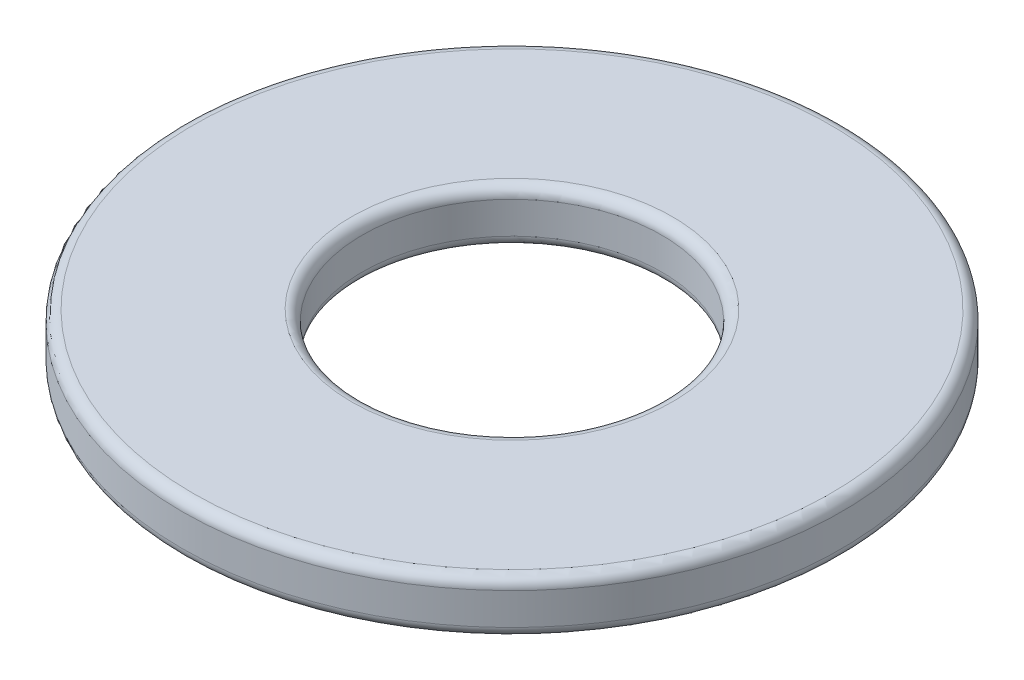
from build123d import *

# Parameters (mm, degrees)
SKETCH1_R      = 6.2865
SKETCH1_R_2    = 2.8575
EXTRUDE1_DEPTH = 1.016
FILLET1_R      = 0.2032


with BuildPart() as part:
    # Sketch1 → Extrude1 (new body)
    with BuildSketch(Plane(origin=(0, 0, 0), x_dir=(1, 0, 0), z_dir=(0, 1, 0))):
        with Locations(Location((0, 0, 0), (0, 0, 270))):
            Circle(SKETCH1_R)
        with Locations(Location((0, 0, 0), (0, 0, 270))):
            Circle(SKETCH1_R_2, mode=Mode.SUBTRACT)
    extrude(amount=EXTRUDE1_DEPTH)

    # Fillet1
    fillet1_edges = [part.edges().sort_by_distance(p)[0] for p in [
        (0, 0, -6.2865),
        (0, 1.016, -6.2865),
        (0, 0, -2.8575),
        (0, 1.016, -2.8575),
    ]]
    fillet(fillet1_edges, radius=FILLET1_R)


solid = part.part
